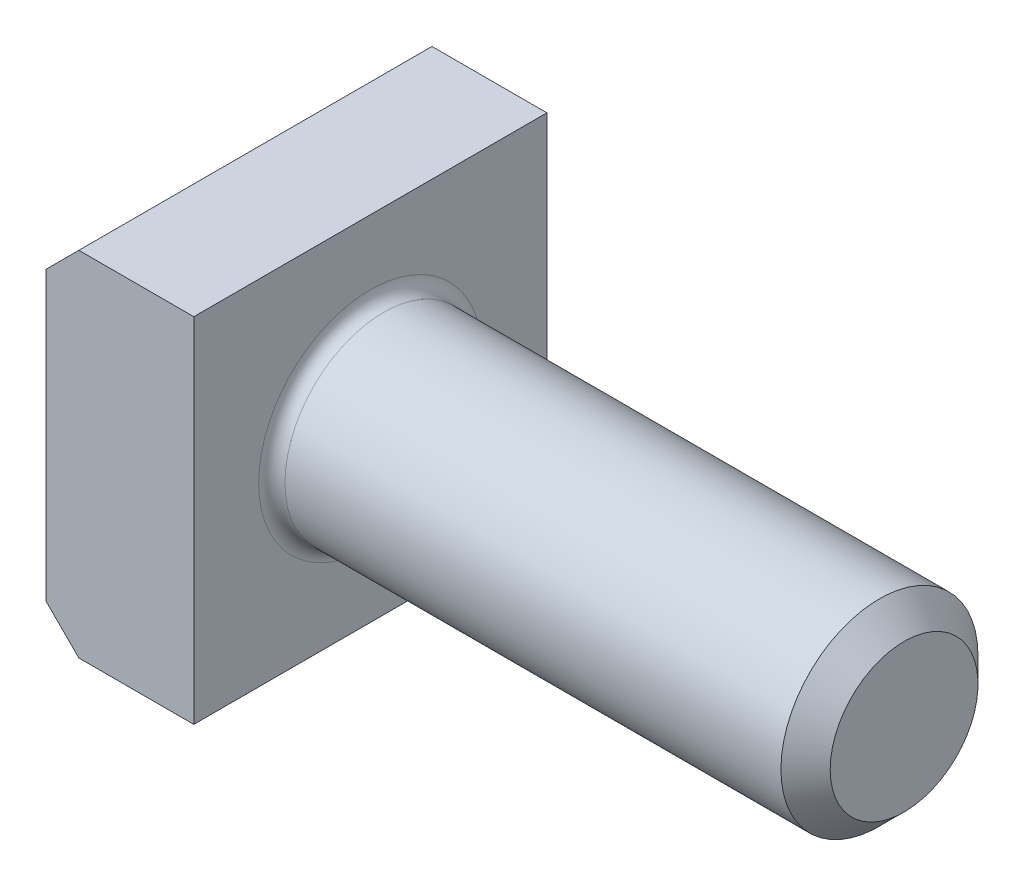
from build123d import *

# Parameters (mm, degrees)
BASEBODYSKE_W = 65
BASEBODYSKE_H = 12
HEAD_DEPTH    = 21.5
FILLET_2_R    = 1.6


with BuildPart() as part:
    # BaseBodySke → BaseBody (revolve)
    with BuildSketch(Plane.XY, mode=Mode.PRIVATE) as basebody_sk:
        with Locations((32.5, 6)):
            Rectangle(BASEBODYSKE_W, BASEBODYSKE_H)
    revolve(basebody_sk.sketch.rotate(Axis((65, 0, 0), (-1, 0, 0)), 90), axis=Axis((65, 0, 0), (-1, 0, 0)))

    # HeadSke → Head (add, symmetric)
    with BuildSketch(Plane.XY):
        Polygon((-14, 21.5), (0, 21.5), (0, -21.5), (-14, -21.5), (-18, -17.5), (-18, 17.5), align=None)
    extrude(amount=HEAD_DEPTH, both=True)

    # FlatEndSke → FlatEnd (revolve, cut)
    with BuildSketch(Plane.XY, mode=Mode.PRIVATE) as flatend_sk:
        Polygon((62, 12), (65, 12), (65, 9), align=None)
    revolve(flatend_sk.sketch.rotate(Axis((0, 0, 0), (1, 0, 0)), 90), axis=Axis((0, 0, 0), (1, 0, 0)), mode=Mode.SUBTRACT)

    # Fillet 2
    fillet_2_edges = [part.edges().sort_by_distance(p)[0] for p in [
        (0, 0, 12),
    ]]
    fillet(fillet_2_edges, radius=FILLET_2_R)


solid = part.part
